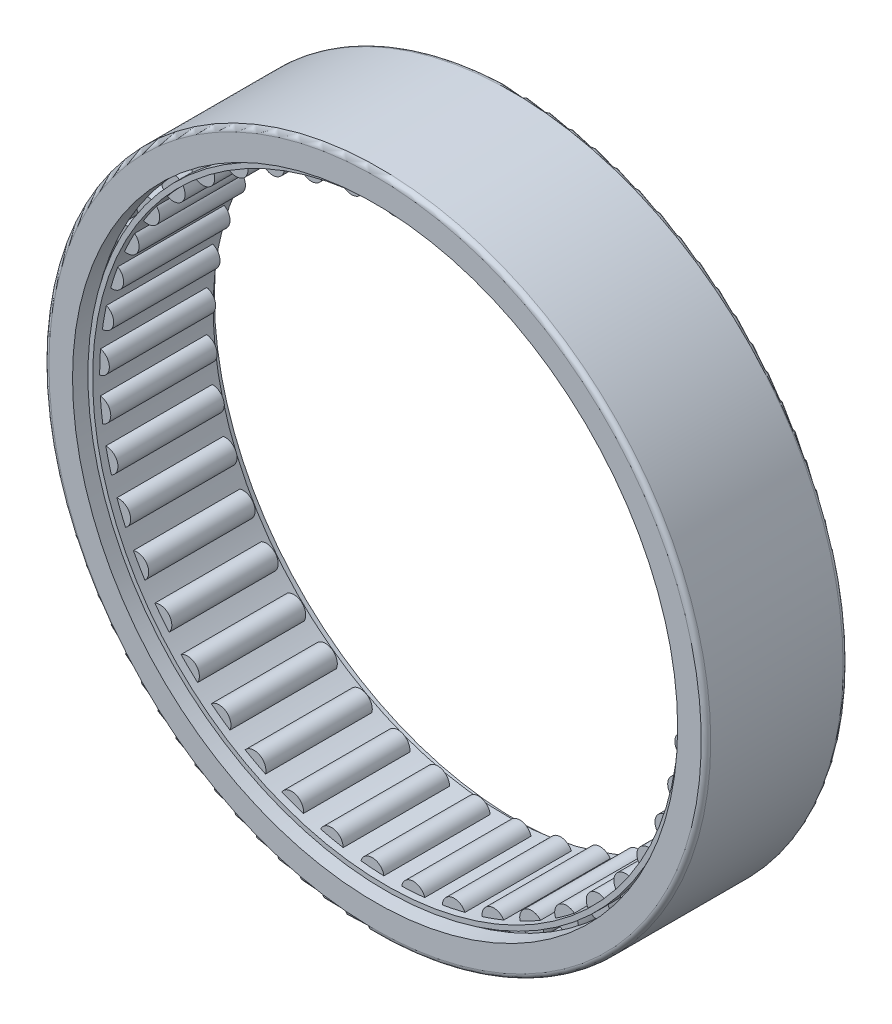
from build123d import *

# Parameters (mm, degrees)
BASESKE_W            = 22.5
BASESKE_H            = 2.5
CAGESKE_W            = 25.5
CAGESKE_H            = 1
FILLET1_R            = 1
CIRPATTERNBALL_COUNT = 45


with BuildPart() as part:
    # BaseSke → Roller (revolve)
    with BuildSketch(Plane(origin=(0, 0, 0), x_dir=(0, 0, -1), z_dir=(1, 0, 0)), mode=Mode.PRIVATE) as roller_sk:
        with Locations((0, 61.25)):
            Rectangle(BASESKE_W, BASESKE_H)
    roller = revolve(roller_sk.sketch.rotate(Axis((0, 62.5, 11.25), (0, 0, -1)), 270), axis=Axis((0, 62.5, 11.25), (0, 0, -1)))

    # OuterRaceSke → OuterRace (revolve)
    with BuildSketch(Plane(origin=(0, 0, 0), x_dir=(0, 0, -1), z_dir=(1, 0, 0)), mode=Mode.PRIVATE) as outerrace_sk:
        Polygon((-15, 70), (15, 70), (15, 64), (11.275, 64), (11.275, 64.98), (-11.275, 64.98), (-11.275, 64), (-15, 64), align=None)
    revolve(outerrace_sk.sketch.rotate(Axis((0, 0, 50.391616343), (0, 0, -1)), 90), axis=Axis((0, 0, 50.391616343), (0, 0, -1)))

    # CageSke → Cage (revolve)
    with BuildSketch(Plane(origin=(0, 0, 0), x_dir=(0, 0, -1), z_dir=(1, 0, 0)), mode=Mode.PRIVATE) as cage_sk:
        with Locations((0, 62.5)):
            Rectangle(CAGESKE_W, CAGESKE_H)
    revolve(cage_sk.sketch.rotate(Axis((0, 0, 70.862590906), (0, 0, -1)), 90), axis=Axis((0, 0, 70.862590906), (0, 0, -1)))

    # Fillet1
    fillet1_edges = [part.edges().sort_by_distance(p)[0] for p in [
        (-70, 0, 15),
        (-70, 0, -15),
    ]]
    fillet(fillet1_edges, radius=FILLET1_R)

    # CirPatternBall: Roller ×45 about axis
    cirpatternball_axis = Axis((0, 0, 0), (0, 0, 1))
    for i in range(1, CIRPATTERNBALL_COUNT):
        add(roller.rotate(cirpatternball_axis, i * 360 / CIRPATTERNBALL_COUNT))


solid = part.part
